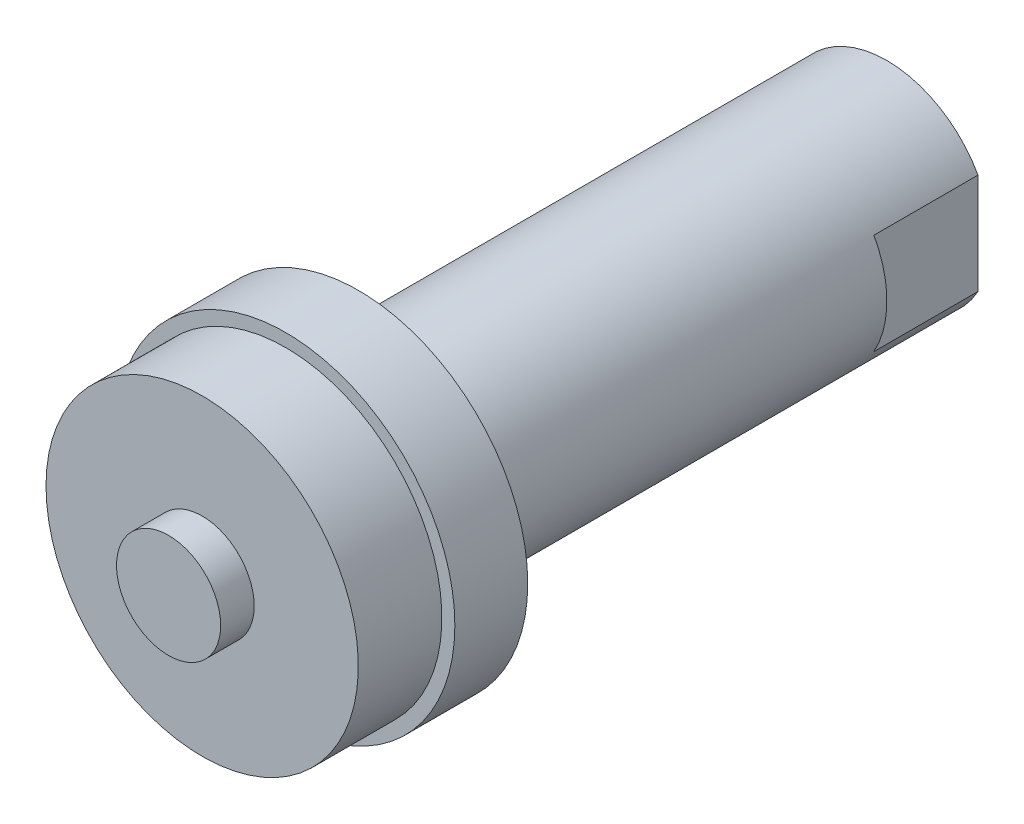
ISO-10303-21;
HEADER;
FILE_DESCRIPTION(('STEP AP214'),'2;1');
FILE_NAME('part.step','',(''),(''),'','','');
FILE_SCHEMA(('AUTOMOTIVE_DESIGN { 1 0 10303 214 1 1 1 1 }'));
ENDSEC;
DATA;
#1=APPLICATION_CONTEXT('core data for automotive mechanical design processes');
#2=APPLICATION_PROTOCOL_DEFINITION('international standard','automotive_design',2000,#1);
#3=PRODUCT_CONTEXT('',#1,'mechanical');
#4=PRODUCT('Part','Part','',(#3));
#5=PRODUCT_RELATED_PRODUCT_CATEGORY('part','',(#4));
#6=PRODUCT_DEFINITION_FORMATION('','',#4);
#7=PRODUCT_DEFINITION_CONTEXT('part definition',#1,'design');
#8=PRODUCT_DEFINITION('design','',#6,#7);
#9=PRODUCT_DEFINITION_SHAPE('','',#8);
#10=(LENGTH_UNIT() NAMED_UNIT(*) SI_UNIT(.MILLI.,.METRE.));
#11=(NAMED_UNIT(*) PLANE_ANGLE_UNIT() SI_UNIT($,.RADIAN.));
#12=(NAMED_UNIT(*) SI_UNIT($,.STERADIAN.) SOLID_ANGLE_UNIT());
#13=UNCERTAINTY_MEASURE_WITH_UNIT(LENGTH_MEASURE(1.E-05),#10,'distance_accuracy_value','');
#14=(GEOMETRIC_REPRESENTATION_CONTEXT(3) GLOBAL_UNCERTAINTY_ASSIGNED_CONTEXT((#13)) GLOBAL_UNIT_ASSIGNED_CONTEXT((#10,
#11,#12)) REPRESENTATION_CONTEXT('',''));
#15=CARTESIAN_POINT('',(0.,0.,0.));
#16=DIRECTION('',(0.,0.,1.));
#17=DIRECTION('',(1.,0.,0.));
#18=AXIS2_PLACEMENT_3D('',#15,#16,#17);
#19=CARTESIAN_POINT('',(0.,0.,-20.3));
#20=DIRECTION('',(0.,0.,1.));
#21=DIRECTION('',(1.,0.,0.));
#22=AXIS2_PLACEMENT_3D('',#19,#20,#21);
#23=PLANE('',#22);
#24=CARTESIAN_POINT('',(0.,0.,-20.3));
#25=DIRECTION('',(0.,0.,-1.));
#26=DIRECTION('',(-1.,0.,0.));
#27=AXIS2_PLACEMENT_3D('',#24,#25,#26);
#28=CIRCLE('',#27,2.);
#29=CARTESIAN_POINT('',(-2.,0.,-20.3));
#30=VERTEX_POINT('',#29);
#31=EDGE_CURVE('E81',#30,#30,#28,.F.);
#32=ORIENTED_EDGE('',*,*,#31,.T.);
#33=EDGE_LOOP('',(#32));
#34=FACE_BOUND('',#33,.T.);
#35=DIRECTION('',(0.,1.,0.));
#36=VECTOR('',#35,1.);
#37=CARTESIAN_POINT('',(3.5,0.,-20.3));
#38=LINE('',#37,#36);
#39=CARTESIAN_POINT('',(3.5,-1.9364916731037,-20.2999999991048));
#40=VERTEX_POINT('',#39);
#41=CARTESIAN_POINT('',(3.5,1.9364916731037,-20.2999999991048));
#42=VERTEX_POINT('',#41);
#43=EDGE_CURVE('E62',#40,#42,#38,.T.);
#44=ORIENTED_EDGE('',*,*,#43,.F.);
#45=CARTESIAN_POINT('',(0.,0.,-20.2999999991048));
#46=DIRECTION('',(0.,0.,1.));
#47=DIRECTION('',(0.,1.,0.));
#48=AXIS2_PLACEMENT_3D('',#45,#46,#47);
#49=CIRCLE('',#48,4.);
#50=CARTESIAN_POINT('',(-3.5,-1.9364916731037,-20.2999999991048));
#51=VERTEX_POINT('',#50);
#52=EDGE_CURVE('E68',#51,#40,#49,.T.);
#53=ORIENTED_EDGE('',*,*,#52,.F.);
#54=DIRECTION('',(0.,-1.,0.));
#55=VECTOR('',#54,1.);
#56=CARTESIAN_POINT('',(-3.5,0.,-20.3));
#57=LINE('',#56,#55);
#58=CARTESIAN_POINT('',(-3.5,1.9364916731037,-20.2999999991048));
#59=VERTEX_POINT('',#58);
#60=EDGE_CURVE('E82',#59,#51,#57,.T.);
#61=ORIENTED_EDGE('',*,*,#60,.F.);
#62=EDGE_CURVE('E85',#42,#59,#49,.T.);
#63=ORIENTED_EDGE('',*,*,#62,.F.);
#64=EDGE_LOOP('',(#44,#53,#61,#63));
#65=FACE_BOUND('',#64,.T.);
#66=ADVANCED_FACE('F14',(#34,#65),#23,.F.);
#67=CARTESIAN_POINT('',(0.,0.,0.));
#68=DIRECTION('',(0.,0.,1.));
#69=DIRECTION('',(0.,1.,0.));
#70=AXIS2_PLACEMENT_3D('',#67,#68,#69);
#71=CYLINDRICAL_SURFACE('',#70,4.);
#72=CARTESIAN_POINT('',(0.,0.,8.95320276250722E-10));
#73=DIRECTION('',(0.,0.,1.));
#74=DIRECTION('',(0.,1.,0.));
#75=AXIS2_PLACEMENT_3D('',#72,#73,#74);
#76=CIRCLE('',#75,4.);
#77=CARTESIAN_POINT('',(0.,4.,8.95319842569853E-10));
#78=VERTEX_POINT('',#77);
#79=EDGE_CURVE('E87',#78,#78,#76,.T.);
#80=ORIENTED_EDGE('',*,*,#79,.F.);
#81=EDGE_LOOP('',(#80));
#82=FACE_BOUND('',#81,.T.);
#83=CARTESIAN_POINT('',(0.,0.,-16.3));
#84=DIRECTION('',(0.,0.,-1.));
#85=DIRECTION('',(-1.,0.,0.));
#86=AXIS2_PLACEMENT_3D('',#83,#84,#85);
#87=CIRCLE('',#86,4.);
#88=CARTESIAN_POINT('',(3.5,-1.9364916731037,-16.3));
#89=VERTEX_POINT('',#88);
#90=CARTESIAN_POINT('',(3.5,1.9364916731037,-16.3));
#91=VERTEX_POINT('',#90);
#92=EDGE_CURVE('E53',#89,#91,#87,.F.);
#93=ORIENTED_EDGE('',*,*,#92,.T.);
#94=DIRECTION('',(0.,0.,1.));
#95=VECTOR('',#94,1.);
#96=CARTESIAN_POINT('',(3.5,1.9364916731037,0.));
#97=LINE('',#96,#95);
#98=EDGE_CURVE('E9',#91,#42,#97,.F.);
#99=ORIENTED_EDGE('',*,*,#98,.T.);
#100=ORIENTED_EDGE('',*,*,#62,.T.);
#101=DIRECTION('',(0.,0.,1.));
#102=VECTOR('',#101,1.);
#103=CARTESIAN_POINT('',(-3.5,1.9364916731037,0.));
#104=LINE('',#103,#102);
#105=CARTESIAN_POINT('',(-3.5,1.9364916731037,-16.3));
#106=VERTEX_POINT('',#105);
#107=EDGE_CURVE('E71',#59,#106,#104,.T.);
#108=ORIENTED_EDGE('',*,*,#107,.T.);
#109=CARTESIAN_POINT('',(0.,0.,-16.3));
#110=DIRECTION('',(0.,0.,-1.));
#111=DIRECTION('',(-1.,0.,0.));
#112=AXIS2_PLACEMENT_3D('',#109,#110,#111);
#113=CIRCLE('',#112,4.);
#114=CARTESIAN_POINT('',(-3.5,-1.9364916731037,-16.3));
#115=VERTEX_POINT('',#114);
#116=EDGE_CURVE('E74',#106,#115,#113,.F.);
#117=ORIENTED_EDGE('',*,*,#116,.T.);
#118=DIRECTION('',(0.,0.,1.));
#119=VECTOR('',#118,1.);
#120=CARTESIAN_POINT('',(-3.5,-1.9364916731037,0.));
#121=LINE('',#120,#119);
#122=EDGE_CURVE('E57',#115,#51,#121,.F.);
#123=ORIENTED_EDGE('',*,*,#122,.T.);
#124=ORIENTED_EDGE('',*,*,#52,.T.);
#125=DIRECTION('',(0.,0.,1.));
#126=VECTOR('',#125,1.);
#127=CARTESIAN_POINT('',(3.5,-1.9364916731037,0.));
#128=LINE('',#127,#126);
#129=EDGE_CURVE('E22',#40,#89,#128,.T.);
#130=ORIENTED_EDGE('',*,*,#129,.T.);
#131=EDGE_LOOP('',(#93,#99,#100,#108,#117,#123,#124,#130));
#132=FACE_BOUND('',#131,.T.);
#133=ADVANCED_FACE('F65',(#82,#132),#71,.T.);
#134=CARTESIAN_POINT('',(0.,0.,-12.3));
#135=DIRECTION('',(0.,0.,-1.));
#136=DIRECTION('',(-1.,0.,0.));
#137=AXIS2_PLACEMENT_3D('',#134,#135,#136);
#138=PLANE('',#137);
#139=CARTESIAN_POINT('',(0.,0.,-12.3));
#140=DIRECTION('',(0.,0.,-1.));
#141=DIRECTION('',(-1.,0.,0.));
#142=AXIS2_PLACEMENT_3D('',#139,#140,#141);
#143=CIRCLE('',#142,2.);
#144=CARTESIAN_POINT('',(-2.,0.,-12.3));
#145=VERTEX_POINT('',#144);
#146=EDGE_CURVE('E78',#145,#145,#143,.F.);
#147=ORIENTED_EDGE('',*,*,#146,.F.);
#148=EDGE_LOOP('',(#147));
#149=FACE_BOUND('',#148,.T.);
#150=ADVANCED_FACE('F126',(#149),#138,.T.);
#151=CARTESIAN_POINT('',(0.,0.,-12.3));
#152=DIRECTION('',(0.,0.,-1.));
#153=DIRECTION('',(-1.,0.,0.));
#154=AXIS2_PLACEMENT_3D('',#151,#152,#153);
#155=CYLINDRICAL_SURFACE('',#154,2.);
#156=ORIENTED_EDGE('',*,*,#146,.T.);
#157=EDGE_LOOP('',(#156));
#158=FACE_BOUND('',#157,.T.);
#159=ORIENTED_EDGE('',*,*,#31,.F.);
#160=EDGE_LOOP('',(#159));
#161=FACE_BOUND('',#160,.T.);
#162=ADVANCED_FACE('F137',(#158,#161),#155,.F.);
#163=CARTESIAN_POINT('',(0.,0.,7.3));
#164=DIRECTION('',(0.,0.,-1.));
#165=DIRECTION('',(-1.,0.,0.));
#166=AXIS2_PLACEMENT_3D('',#163,#164,#165);
#167=PLANE('',#166);
#168=CARTESIAN_POINT('',(0.,0.,7.300000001));
#169=DIRECTION('',(0.,0.,1.));
#170=DIRECTION('',(1.,0.,0.));
#171=AXIS2_PLACEMENT_3D('',#168,#169,#170);
#172=CIRCLE('',#171,2.);
#173=CARTESIAN_POINT('',(2.,0.,7.300000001));
#174=VERTEX_POINT('',#173);
#175=EDGE_CURVE('E90',#174,#174,#172,.F.);
#176=ORIENTED_EDGE('',*,*,#175,.F.);
#177=EDGE_LOOP('',(#176));
#178=FACE_BOUND('',#177,.T.);
#179=ADVANCED_FACE('F140',(#178),#167,.F.);
#180=CARTESIAN_POINT('',(0.,6.5,0.));
#181=DIRECTION('',(0.,0.,1.));
#182=DIRECTION('',(1.,0.,0.));
#183=AXIS2_PLACEMENT_3D('',#180,#181,#182);
#184=PLANE('',#183);
#185=ORIENTED_EDGE('',*,*,#79,.T.);
#186=EDGE_LOOP('',(#185));
#187=FACE_BOUND('',#186,.T.);
#188=CARTESIAN_POINT('',(0.,0.,8.95320276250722E-10));
#189=DIRECTION('',(0.,0.,1.));
#190=DIRECTION('',(1.,0.,0.));
#191=AXIS2_PLACEMENT_3D('',#188,#189,#190);
#192=CIRCLE('',#191,6.5);
#193=CARTESIAN_POINT('',(6.5,0.,8.95320276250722E-10));
#194=VERTEX_POINT('',#193);
#195=EDGE_CURVE('E93',#194,#194,#192,.T.);
#196=ORIENTED_EDGE('',*,*,#195,.F.);
#197=EDGE_LOOP('',(#196));
#198=FACE_BOUND('',#197,.T.);
#199=ADVANCED_FACE('F143',(#187,#198),#184,.F.);
#200=CARTESIAN_POINT('',(0.,0.,7.300000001));
#201=DIRECTION('',(0.,0.,1.));
#202=DIRECTION('',(1.,0.,0.));
#203=AXIS2_PLACEMENT_3D('',#200,#201,#202);
#204=CYLINDRICAL_SURFACE('',#203,2.);
#205=ORIENTED_EDGE('',*,*,#175,.T.);
#206=EDGE_LOOP('',(#205));
#207=FACE_BOUND('',#206,.T.);
#208=CARTESIAN_POINT('',(0.,0.,6.009994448));
#209=DIRECTION('',(0.,0.,1.));
#210=DIRECTION('',(1.,0.,0.));
#211=AXIS2_PLACEMENT_3D('',#208,#209,#210);
#212=CIRCLE('',#211,2.);
#213=CARTESIAN_POINT('',(2.,0.,6.009994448));
#214=VERTEX_POINT('',#213);
#215=EDGE_CURVE('E96',#214,#214,#212,.F.);
#216=ORIENTED_EDGE('',*,*,#215,.F.);
#217=EDGE_LOOP('',(#216));
#218=FACE_BOUND('',#217,.T.);
#219=ADVANCED_FACE('F147',(#207,#218),#204,.T.);
#220=CARTESIAN_POINT('',(0.,0.,2.8));
#221=DIRECTION('',(0.,0.,1.));
#222=DIRECTION('',(1.,0.,0.));
#223=AXIS2_PLACEMENT_3D('',#220,#221,#222);
#224=CYLINDRICAL_SURFACE('',#223,6.5);
#225=ORIENTED_EDGE('',*,*,#195,.T.);
#226=EDGE_LOOP('',(#225));
#227=FACE_BOUND('',#226,.T.);
#228=CARTESIAN_POINT('',(0.,0.,2.80000000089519));
#229=DIRECTION('',(0.,0.,1.));
#230=DIRECTION('',(1.,0.,0.));
#231=AXIS2_PLACEMENT_3D('',#228,#229,#230);
#232=CIRCLE('',#231,6.5);
#233=CARTESIAN_POINT('',(6.5,0.,2.80000000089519));
#234=VERTEX_POINT('',#233);
#235=EDGE_CURVE('E99',#234,#234,#232,.T.);
#236=ORIENTED_EDGE('',*,*,#235,.F.);
#237=EDGE_LOOP('',(#236));
#238=FACE_BOUND('',#237,.T.);
#239=ADVANCED_FACE('F151',(#227,#238),#224,.T.);
#240=CARTESIAN_POINT('',(0.,0.,6.009994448));
#241=DIRECTION('',(0.,0.,1.));
#242=DIRECTION('',(1.,0.,0.));
#243=AXIS2_PLACEMENT_3D('',#240,#241,#242);
#244=PLANE('',#243);
#245=ORIENTED_EDGE('',*,*,#215,.T.);
#246=EDGE_LOOP('',(#245));
#247=FACE_BOUND('',#246,.T.);
#248=CARTESIAN_POINT('',(0.,0.,6.009994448));
#249=DIRECTION('',(0.,0.,-1.));
#250=DIRECTION('',(-1.,0.,0.));
#251=AXIS2_PLACEMENT_3D('',#248,#249,#250);
#252=CIRCLE('',#251,6.);
#253=CARTESIAN_POINT('',(-6.,0.,6.009994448));
#254=VERTEX_POINT('',#253);
#255=EDGE_CURVE('E102',#254,#254,#252,.T.);
#256=ORIENTED_EDGE('',*,*,#255,.F.);
#257=EDGE_LOOP('',(#256));
#258=FACE_BOUND('',#257,.T.);
#259=ADVANCED_FACE('F155',(#247,#258),#244,.T.);
#260=CARTESIAN_POINT('',(0.,2.,2.8));
#261=DIRECTION('',(0.,0.,-1.));
#262=DIRECTION('',(-1.,0.,0.));
#263=AXIS2_PLACEMENT_3D('',#260,#261,#262);
#264=PLANE('',#263);
#265=CARTESIAN_POINT('',(0.,0.,2.80000000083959));
#266=DIRECTION('',(0.,0.,-1.));
#267=DIRECTION('',(-1.,0.,0.));
#268=AXIS2_PLACEMENT_3D('',#265,#266,#267);
#269=CIRCLE('',#268,6.);
#270=CARTESIAN_POINT('',(-6.,0.,2.80000000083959));
#271=VERTEX_POINT('',#270);
#272=EDGE_CURVE('E77',#271,#271,#269,.F.);
#273=ORIENTED_EDGE('',*,*,#272,.F.);
#274=EDGE_LOOP('',(#273));
#275=FACE_BOUND('',#274,.T.);
#276=ORIENTED_EDGE('',*,*,#235,.T.);
#277=EDGE_LOOP('',(#276));
#278=FACE_BOUND('',#277,.T.);
#279=ADVANCED_FACE('F158',(#275,#278),#264,.F.);
#280=CARTESIAN_POINT('',(0.,0.,2.8));
#281=DIRECTION('',(0.,0.,-1.));
#282=DIRECTION('',(-1.,0.,0.));
#283=AXIS2_PLACEMENT_3D('',#280,#281,#282);
#284=CYLINDRICAL_SURFACE('',#283,6.);
#285=ORIENTED_EDGE('',*,*,#272,.T.);
#286=EDGE_LOOP('',(#285));
#287=FACE_BOUND('',#286,.T.);
#288=ORIENTED_EDGE('',*,*,#255,.T.);
#289=EDGE_LOOP('',(#288));
#290=FACE_BOUND('',#289,.T.);
#291=ADVANCED_FACE('F16',(#287,#290),#284,.T.);
#292=CARTESIAN_POINT('',(-3.5,6.5,-23.5284466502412));
#293=DIRECTION('',(-1.,0.,0.));
#294=DIRECTION('',(0.,0.,1.));
#295=AXIS2_PLACEMENT_3D('',#292,#293,#294);
#296=PLANE('',#295);
#297=DIRECTION('',(0.,-1.,0.));
#298=VECTOR('',#297,1.);
#299=CARTESIAN_POINT('',(-3.5,6.5,-16.3));
#300=LINE('',#299,#298);
#301=EDGE_CURVE('E35',#106,#115,#300,.T.);
#302=ORIENTED_EDGE('',*,*,#301,.F.);
#303=ORIENTED_EDGE('',*,*,#107,.F.);
#304=ORIENTED_EDGE('',*,*,#60,.T.);
#305=ORIENTED_EDGE('',*,*,#122,.F.);
#306=EDGE_LOOP('',(#302,#303,#304,#305));
#307=FACE_BOUND('',#306,.T.);
#308=ADVANCED_FACE('F114',(#307),#296,.T.);
#309=CARTESIAN_POINT('',(-3.5,6.5,-16.3));
#310=DIRECTION('',(0.,0.,-1.));
#311=DIRECTION('',(-1.,0.,0.));
#312=AXIS2_PLACEMENT_3D('',#309,#310,#311);
#313=PLANE('',#312);
#314=ORIENTED_EDGE('',*,*,#301,.T.);
#315=ORIENTED_EDGE('',*,*,#116,.F.);
#316=EDGE_LOOP('',(#314,#315));
#317=FACE_BOUND('',#316,.T.);
#318=ADVANCED_FACE('F115',(#317),#313,.T.);
#319=CARTESIAN_POINT('',(3.5,6.5,-23.5284466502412));
#320=DIRECTION('',(1.,0.,0.));
#321=DIRECTION('',(0.,0.,-1.));
#322=AXIS2_PLACEMENT_3D('',#319,#320,#321);
#323=PLANE('',#322);
#324=DIRECTION('',(0.,-1.,0.));
#325=VECTOR('',#324,1.);
#326=CARTESIAN_POINT('',(3.5,6.5,-16.3));
#327=LINE('',#326,#325);
#328=EDGE_CURVE('E28',#91,#89,#327,.T.);
#329=ORIENTED_EDGE('',*,*,#328,.T.);
#330=ORIENTED_EDGE('',*,*,#129,.F.);
#331=ORIENTED_EDGE('',*,*,#43,.T.);
#332=ORIENTED_EDGE('',*,*,#98,.F.);
#333=EDGE_LOOP('',(#329,#330,#331,#332));
#334=FACE_BOUND('',#333,.T.);
#335=ADVANCED_FACE('F60',(#334),#323,.T.);
#336=CARTESIAN_POINT('',(3.5,6.5,-16.3));
#337=DIRECTION('',(0.,0.,-1.));
#338=DIRECTION('',(-1.,0.,0.));
#339=AXIS2_PLACEMENT_3D('',#336,#337,#338);
#340=PLANE('',#339);
#341=ORIENTED_EDGE('',*,*,#328,.F.);
#342=ORIENTED_EDGE('',*,*,#92,.F.);
#343=EDGE_LOOP('',(#341,#342));
#344=FACE_BOUND('',#343,.T.);
#345=ADVANCED_FACE('F54',(#344),#340,.T.);
#346=CLOSED_SHELL('',(#66,#133,#150,#162,#179,#199,#219,#239,#259,#279,#291,#308,#318,#335,#345));
#347=MANIFOLD_SOLID_BREP('B1',#346);
#348=ADVANCED_BREP_SHAPE_REPRESENTATION('',(#18,#347),#14);
#349=SHAPE_DEFINITION_REPRESENTATION(#9,#348);
ENDSEC;
END-ISO-10303-21;
